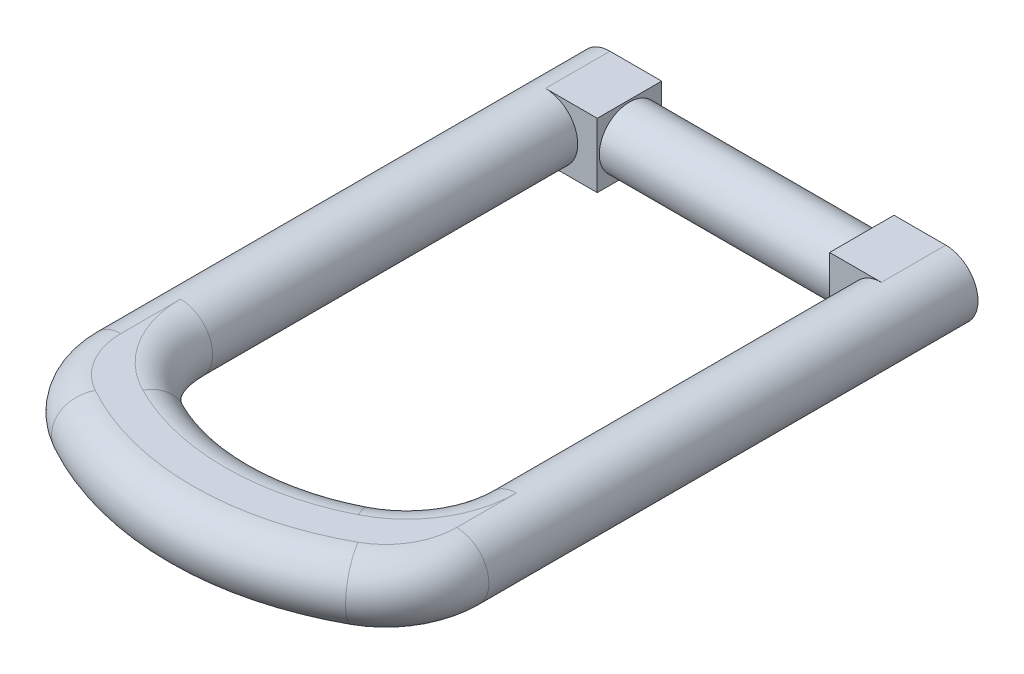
ISO-10303-21;
HEADER;
FILE_DESCRIPTION(('STEP AP214'),'2;1');
FILE_NAME('part.step','',(''),(''),'','','');
FILE_SCHEMA(('AUTOMOTIVE_DESIGN { 1 0 10303 214 1 1 1 1 }'));
ENDSEC;
DATA;
#1=APPLICATION_CONTEXT('core data for automotive mechanical design processes');
#2=APPLICATION_PROTOCOL_DEFINITION('international standard','automotive_design',2000,#1);
#3=PRODUCT_CONTEXT('',#1,'mechanical');
#4=PRODUCT('Part','Part','',(#3));
#5=PRODUCT_RELATED_PRODUCT_CATEGORY('part','',(#4));
#6=PRODUCT_DEFINITION_FORMATION('','',#4);
#7=PRODUCT_DEFINITION_CONTEXT('part definition',#1,'design');
#8=PRODUCT_DEFINITION('design','',#6,#7);
#9=PRODUCT_DEFINITION_SHAPE('','',#8);
#10=(LENGTH_UNIT() NAMED_UNIT(*) SI_UNIT(.MILLI.,.METRE.));
#11=(NAMED_UNIT(*) PLANE_ANGLE_UNIT() SI_UNIT($,.RADIAN.));
#12=(NAMED_UNIT(*) SI_UNIT($,.STERADIAN.) SOLID_ANGLE_UNIT());
#13=UNCERTAINTY_MEASURE_WITH_UNIT(LENGTH_MEASURE(1.E-05),#10,'distance_accuracy_value','');
#14=(GEOMETRIC_REPRESENTATION_CONTEXT(3) GLOBAL_UNCERTAINTY_ASSIGNED_CONTEXT((#13)) GLOBAL_UNIT_ASSIGNED_CONTEXT((#10,
#11,#12)) REPRESENTATION_CONTEXT('',''));
#15=CARTESIAN_POINT('',(0.,0.,0.));
#16=DIRECTION('',(0.,0.,1.));
#17=DIRECTION('',(1.,0.,0.));
#18=AXIS2_PLACEMENT_3D('',#15,#16,#17);
#19=CARTESIAN_POINT('',(50.0632034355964,0.,0.));
#20=DIRECTION('',(-1.,0.,0.));
#21=DIRECTION('',(0.,-1.,0.));
#22=AXIS2_PLACEMENT_3D('',#19,#20,#21);
#23=CYLINDRICAL_SURFACE('',#22,7.5);
#24=CARTESIAN_POINT('',(-28.85,0.,0.));
#25=DIRECTION('',(-1.,0.,0.));
#26=DIRECTION('',(0.,-1.,0.));
#27=AXIS2_PLACEMENT_3D('',#24,#25,#26);
#28=CIRCLE('',#27,7.5);
#29=CARTESIAN_POINT('',(-28.85,-7.5,0.));
#30=VERTEX_POINT('',#29);
#31=EDGE_CURVE('E208',#30,#30,#28,.F.);
#32=ORIENTED_EDGE('',*,*,#31,.T.);
#33=EDGE_LOOP('',(#32));
#34=FACE_BOUND('',#33,.T.);
#35=CARTESIAN_POINT('',(28.85,0.,0.));
#36=DIRECTION('',(1.,0.,0.));
#37=DIRECTION('',(0.,1.,0.));
#38=AXIS2_PLACEMENT_3D('',#35,#36,#37);
#39=CIRCLE('',#38,7.5);
#40=CARTESIAN_POINT('',(28.85,7.5,0.));
#41=VERTEX_POINT('',#40);
#42=EDGE_CURVE('E205',#41,#41,#39,.F.);
#43=ORIENTED_EDGE('',*,*,#42,.T.);
#44=EDGE_LOOP('',(#43));
#45=FACE_BOUND('',#44,.T.);
#46=ADVANCED_FACE('F14',(#34,#45),#23,.T.);
#47=CARTESIAN_POINT('',(-28.85,-68.95,-54.5));
#48=DIRECTION('',(-1.,0.,0.));
#49=DIRECTION('',(0.,-1.,0.));
#50=AXIS2_PLACEMENT_3D('',#47,#48,#49);
#51=PLANE('',#50);
#52=ORIENTED_EDGE('',*,*,#31,.F.);
#53=EDGE_LOOP('',(#52));
#54=FACE_BOUND('',#53,.T.);
#55=DIRECTION('',(0.,0.,1.));
#56=VECTOR('',#55,1.);
#57=CARTESIAN_POINT('',(-28.85,-8.,19.2));
#58=LINE('',#57,#56);
#59=CARTESIAN_POINT('',(-28.85,-8.,-8.));
#60=VERTEX_POINT('',#59);
#61=CARTESIAN_POINT('',(-28.85,-8.,8.));
#62=VERTEX_POINT('',#61);
#63=EDGE_CURVE('E197',#60,#62,#58,.T.);
#64=ORIENTED_EDGE('',*,*,#63,.F.);
#65=DIRECTION('',(0.,-1.,0.));
#66=VECTOR('',#65,1.);
#67=CARTESIAN_POINT('',(-28.85,19.25,-8.));
#68=LINE('',#67,#66);
#69=CARTESIAN_POINT('',(-28.85,8.,-8.));
#70=VERTEX_POINT('',#69);
#71=EDGE_CURVE('E191',#70,#60,#68,.T.);
#72=ORIENTED_EDGE('',*,*,#71,.F.);
#73=DIRECTION('',(0.,0.,1.));
#74=VECTOR('',#73,1.);
#75=CARTESIAN_POINT('',(-28.85,8.,19.2));
#76=LINE('',#75,#74);
#77=CARTESIAN_POINT('',(-28.85,8.,8.));
#78=VERTEX_POINT('',#77);
#79=EDGE_CURVE('E189',#70,#78,#76,.T.);
#80=ORIENTED_EDGE('',*,*,#79,.T.);
#81=DIRECTION('',(0.,1.,0.));
#82=VECTOR('',#81,1.);
#83=CARTESIAN_POINT('',(-28.85,19.25,8.));
#84=LINE('',#83,#82);
#85=EDGE_CURVE('E194',#62,#78,#84,.T.);
#86=ORIENTED_EDGE('',*,*,#85,.F.);
#87=EDGE_LOOP('',(#64,#72,#80,#86));
#88=FACE_BOUND('',#87,.T.);
#89=ADVANCED_FACE('F275',(#54,#88),#51,.F.);
#90=CARTESIAN_POINT('',(-24.1,-8.,101.46584866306));
#91=DIRECTION('',(0.,1.,0.));
#92=DIRECTION('',(-1.,0.,0.));
#93=AXIS2_PLACEMENT_3D('',#90,#91,#92);
#94=PLANE('',#93);
#95=DIRECTION('',(-1.,0.,0.));
#96=VECTOR('',#95,1.);
#97=CARTESIAN_POINT('',(-33.7,-8.,8.));
#98=LINE('',#97,#96);
#99=CARTESIAN_POINT('',(-41.7,-8.,8.));
#100=VERTEX_POINT('',#99);
#101=EDGE_CURVE('E171',#62,#100,#98,.T.);
#102=ORIENTED_EDGE('',*,*,#101,.T.);
#103=DIRECTION('',(0.,0.,-1.));
#104=VECTOR('',#103,1.);
#105=CARTESIAN_POINT('',(-41.7,-8.,101.46584866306));
#106=LINE('',#105,#104);
#107=CARTESIAN_POINT('',(-41.7,-8.,-8.));
#108=VERTEX_POINT('',#107);
#109=EDGE_CURVE('E33',#100,#108,#106,.T.);
#110=ORIENTED_EDGE('',*,*,#109,.T.);
#111=DIRECTION('',(1.,0.,0.));
#112=VECTOR('',#111,1.);
#113=CARTESIAN_POINT('',(-49.7,-8.,-8.));
#114=LINE('',#113,#112);
#115=EDGE_CURVE('E179',#108,#60,#114,.T.);
#116=ORIENTED_EDGE('',*,*,#115,.T.);
#117=ORIENTED_EDGE('',*,*,#63,.T.);
#118=EDGE_LOOP('',(#102,#110,#116,#117));
#119=FACE_BOUND('',#118,.T.);
#120=ADVANCED_FACE('F286',(#119),#94,.F.);
#121=CARTESIAN_POINT('',(-41.7,0.,101.46584866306));
#122=DIRECTION('',(0.,0.,-1.));
#123=DIRECTION('',(-1.,0.,0.));
#124=AXIS2_PLACEMENT_3D('',#121,#122,#123);
#125=CYLINDRICAL_SURFACE('',#124,8.);
#126=DIRECTION('',(0.,0.,-1.));
#127=VECTOR('',#126,1.);
#128=CARTESIAN_POINT('',(-41.7,8.,113.46584866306));
#129=LINE('',#128,#127);
#130=CARTESIAN_POINT('',(-41.7,8.,98.63843571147));
#131=VERTEX_POINT('',#130);
#132=CARTESIAN_POINT('',(-41.7,8.,113.46584866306));
#133=VERTEX_POINT('',#132);
#134=EDGE_CURVE('E231',#131,#133,#129,.F.);
#135=ORIENTED_EDGE('',*,*,#134,.F.);
#136=CARTESIAN_POINT('',(-41.7,0.,98.63843571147));
#137=DIRECTION('',(0.,0.,1.));
#138=DIRECTION('',(0.,1.,0.));
#139=AXIS2_PLACEMENT_3D('',#136,#137,#138);
#140=CIRCLE('',#139,8.);
#141=CARTESIAN_POINT('',(-41.7,-8.,98.63843571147));
#142=VERTEX_POINT('',#141);
#143=EDGE_CURVE('E219',#142,#131,#140,.T.);
#144=ORIENTED_EDGE('',*,*,#143,.F.);
#145=DIRECTION('',(0.,0.,-1.));
#146=VECTOR('',#145,1.);
#147=CARTESIAN_POINT('',(-41.7,-8.,113.46584866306));
#148=LINE('',#147,#146);
#149=CARTESIAN_POINT('',(-41.7,-8.,113.46584866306));
#150=VERTEX_POINT('',#149);
#151=EDGE_CURVE('E86',#150,#142,#148,.T.);
#152=ORIENTED_EDGE('',*,*,#151,.F.);
#153=CARTESIAN_POINT('',(-41.7,0.,113.46584866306));
#154=DIRECTION('',(0.,0.,-1.));
#155=DIRECTION('',(0.,-1.,0.));
#156=AXIS2_PLACEMENT_3D('',#153,#154,#155);
#157=CIRCLE('',#156,8.);
#158=EDGE_CURVE('E224',#150,#133,#157,.T.);
#159=ORIENTED_EDGE('',*,*,#158,.T.);
#160=EDGE_LOOP('',(#135,#144,#152,#159));
#161=FACE_BOUND('',#160,.T.);
#162=ORIENTED_EDGE('',*,*,#109,.F.);
#163=CARTESIAN_POINT('',(-41.7,0.,8.));
#164=DIRECTION('',(0.,0.,-1.));
#165=DIRECTION('',(0.,1.,0.));
#166=AXIS2_PLACEMENT_3D('',#163,#164,#165);
#167=CIRCLE('',#166,8.);
#168=CARTESIAN_POINT('',(-41.7,8.,8.));
#169=VERTEX_POINT('',#168);
#170=EDGE_CURVE('E24',#169,#100,#167,.T.);
#171=ORIENTED_EDGE('',*,*,#170,.F.);
#172=DIRECTION('',(0.,0.,-1.));
#173=VECTOR('',#172,1.);
#174=CARTESIAN_POINT('',(-41.7,8.,101.46584866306));
#175=LINE('',#174,#173);
#176=CARTESIAN_POINT('',(-41.7,8.,-8.));
#177=VERTEX_POINT('',#176);
#178=EDGE_CURVE('E158',#177,#169,#175,.F.);
#179=ORIENTED_EDGE('',*,*,#178,.F.);
#180=CARTESIAN_POINT('',(-41.7,0.,-8.));
#181=DIRECTION('',(0.,0.,1.));
#182=DIRECTION('',(1.,0.,0.));
#183=AXIS2_PLACEMENT_3D('',#180,#181,#182);
#184=CIRCLE('',#183,8.);
#185=EDGE_CURVE('E203',#108,#177,#184,.F.);
#186=ORIENTED_EDGE('',*,*,#185,.F.);
#187=EDGE_LOOP('',(#162,#171,#179,#186));
#188=FACE_BOUND('',#187,.T.);
#189=ADVANCED_FACE('F297',(#161,#188),#125,.T.);
#190=CARTESIAN_POINT('',(-49.7,-8.,-8.));
#191=DIRECTION('',(0.,0.,1.));
#192=DIRECTION('',(1.,0.,0.));
#193=AXIS2_PLACEMENT_3D('',#190,#191,#192);
#194=PLANE('',#193);
#195=ORIENTED_EDGE('',*,*,#185,.T.);
#196=DIRECTION('',(1.,0.,0.));
#197=VECTOR('',#196,1.);
#198=CARTESIAN_POINT('',(-49.7,8.,-8.));
#199=LINE('',#198,#197);
#200=EDGE_CURVE('E173',#177,#70,#199,.T.);
#201=ORIENTED_EDGE('',*,*,#200,.T.);
#202=ORIENTED_EDGE('',*,*,#71,.T.);
#203=ORIENTED_EDGE('',*,*,#115,.F.);
#204=EDGE_LOOP('',(#195,#201,#202,#203));
#205=FACE_BOUND('',#204,.T.);
#206=ADVANCED_FACE('F277',(#205),#194,.F.);
#207=CARTESIAN_POINT('',(-24.1,8.,101.46584866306));
#208=DIRECTION('',(0.,1.,0.));
#209=DIRECTION('',(-1.,0.,0.));
#210=AXIS2_PLACEMENT_3D('',#207,#208,#209);
#211=PLANE('',#210);
#212=ORIENTED_EDGE('',*,*,#178,.T.);
#213=DIRECTION('',(-1.,0.,0.));
#214=VECTOR('',#213,1.);
#215=CARTESIAN_POINT('',(-33.7,8.,8.));
#216=LINE('',#215,#214);
#217=EDGE_CURVE('E154',#78,#169,#216,.T.);
#218=ORIENTED_EDGE('',*,*,#217,.F.);
#219=ORIENTED_EDGE('',*,*,#79,.F.);
#220=ORIENTED_EDGE('',*,*,#200,.F.);
#221=EDGE_LOOP('',(#212,#218,#219,#220));
#222=FACE_BOUND('',#221,.T.);
#223=ADVANCED_FACE('F272',(#222),#211,.T.);
#224=CARTESIAN_POINT('',(-33.7,-8.,8.));
#225=DIRECTION('',(0.,0.,-1.));
#226=DIRECTION('',(0.,-1.,0.));
#227=AXIS2_PLACEMENT_3D('',#224,#225,#226);
#228=PLANE('',#227);
#229=ORIENTED_EDGE('',*,*,#217,.T.);
#230=ORIENTED_EDGE('',*,*,#170,.T.);
#231=ORIENTED_EDGE('',*,*,#101,.F.);
#232=ORIENTED_EDGE('',*,*,#85,.T.);
#233=EDGE_LOOP('',(#229,#230,#231,#232));
#234=FACE_BOUND('',#233,.T.);
#235=ADVANCED_FACE('F269',(#234),#228,.F.);
#236=CARTESIAN_POINT('',(49.7,-8.,-8.));
#237=DIRECTION('',(0.,0.,1.));
#238=DIRECTION('',(1.,0.,0.));
#239=AXIS2_PLACEMENT_3D('',#236,#237,#238);
#240=PLANE('',#239);
#241=DIRECTION('',(1.,0.,0.));
#242=VECTOR('',#241,1.);
#243=CARTESIAN_POINT('',(49.7,8.,-8.));
#244=LINE('',#243,#242);
#245=CARTESIAN_POINT('',(28.85,8.,-8.));
#246=VERTEX_POINT('',#245);
#247=CARTESIAN_POINT('',(41.7,8.,-8.));
#248=VERTEX_POINT('',#247);
#249=EDGE_CURVE('E153',#246,#248,#244,.T.);
#250=ORIENTED_EDGE('',*,*,#249,.T.);
#251=CARTESIAN_POINT('',(41.7,0.,-8.));
#252=DIRECTION('',(0.,0.,1.));
#253=DIRECTION('',(1.,0.,0.));
#254=AXIS2_PLACEMENT_3D('',#251,#252,#253);
#255=CIRCLE('',#254,8.);
#256=CARTESIAN_POINT('',(41.7,-8.,-8.));
#257=VERTEX_POINT('',#256);
#258=EDGE_CURVE('E156',#248,#257,#255,.F.);
#259=ORIENTED_EDGE('',*,*,#258,.T.);
#260=DIRECTION('',(1.,0.,0.));
#261=VECTOR('',#260,1.);
#262=CARTESIAN_POINT('',(49.7,-8.,-8.));
#263=LINE('',#262,#261);
#264=CARTESIAN_POINT('',(28.85,-8.,-8.));
#265=VERTEX_POINT('',#264);
#266=EDGE_CURVE('E175',#265,#257,#263,.T.);
#267=ORIENTED_EDGE('',*,*,#266,.F.);
#268=DIRECTION('',(0.,1.,0.));
#269=VECTOR('',#268,1.);
#270=CARTESIAN_POINT('',(28.85,19.25,-8.));
#271=LINE('',#270,#269);
#272=EDGE_CURVE('E166',#265,#246,#271,.T.);
#273=ORIENTED_EDGE('',*,*,#272,.T.);
#274=EDGE_LOOP('',(#250,#259,#267,#273));
#275=FACE_BOUND('',#274,.T.);
#276=ADVANCED_FACE('F280',(#275),#240,.F.);
#277=CARTESIAN_POINT('',(28.85,-68.95,-54.5));
#278=DIRECTION('',(1.,0.,0.));
#279=DIRECTION('',(0.,1.,0.));
#280=AXIS2_PLACEMENT_3D('',#277,#278,#279);
#281=PLANE('',#280);
#282=ORIENTED_EDGE('',*,*,#42,.F.);
#283=EDGE_LOOP('',(#282));
#284=FACE_BOUND('',#283,.T.);
#285=DIRECTION('',(0.,0.,-1.));
#286=VECTOR('',#285,1.);
#287=CARTESIAN_POINT('',(28.85,8.,19.2));
#288=LINE('',#287,#286);
#289=CARTESIAN_POINT('',(28.85,8.,8.));
#290=VERTEX_POINT('',#289);
#291=EDGE_CURVE('E152',#290,#246,#288,.T.);
#292=ORIENTED_EDGE('',*,*,#291,.T.);
#293=ORIENTED_EDGE('',*,*,#272,.F.);
#294=DIRECTION('',(0.,0.,-1.));
#295=VECTOR('',#294,1.);
#296=CARTESIAN_POINT('',(28.85,-8.,19.2));
#297=LINE('',#296,#295);
#298=CARTESIAN_POINT('',(28.85,-8.,8.));
#299=VERTEX_POINT('',#298);
#300=EDGE_CURVE('E187',#299,#265,#297,.T.);
#301=ORIENTED_EDGE('',*,*,#300,.F.);
#302=DIRECTION('',(0.,-1.,0.));
#303=VECTOR('',#302,1.);
#304=CARTESIAN_POINT('',(28.85,19.25,8.));
#305=LINE('',#304,#303);
#306=EDGE_CURVE('E161',#290,#299,#305,.T.);
#307=ORIENTED_EDGE('',*,*,#306,.F.);
#308=EDGE_LOOP('',(#292,#293,#301,#307));
#309=FACE_BOUND('',#308,.T.);
#310=ADVANCED_FACE('F282',(#284,#309),#281,.F.);
#311=DIRECTION('',(-1.,0.,0.));
#312=VECTOR('',#311,1.);
#313=CARTESIAN_POINT('',(33.7,8.,8.));
#314=LINE('',#313,#312);
#315=CARTESIAN_POINT('',(41.7,8.,8.));
#316=VERTEX_POINT('',#315);
#317=EDGE_CURVE('E139',#316,#290,#314,.T.);
#318=ORIENTED_EDGE('',*,*,#317,.F.);
#319=DIRECTION('',(0.,0.,1.));
#320=VECTOR('',#319,1.);
#321=CARTESIAN_POINT('',(41.7,8.,-8.));
#322=LINE('',#321,#320);
#323=EDGE_CURVE('E18',#316,#248,#322,.F.);
#324=ORIENTED_EDGE('',*,*,#323,.T.);
#325=ORIENTED_EDGE('',*,*,#249,.F.);
#326=ORIENTED_EDGE('',*,*,#291,.F.);
#327=EDGE_LOOP('',(#318,#324,#325,#326));
#328=FACE_BOUND('',#327,.T.);
#329=ADVANCED_FACE('F149',(#328),#211,.T.);
#330=DIRECTION('',(0.,0.,1.));
#331=VECTOR('',#330,1.);
#332=CARTESIAN_POINT('',(41.7,-8.,101.46584866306));
#333=LINE('',#332,#331);
#334=CARTESIAN_POINT('',(41.7,-8.,8.));
#335=VERTEX_POINT('',#334);
#336=EDGE_CURVE('E157',#257,#335,#333,.T.);
#337=ORIENTED_EDGE('',*,*,#336,.T.);
#338=DIRECTION('',(-1.,0.,0.));
#339=VECTOR('',#338,1.);
#340=CARTESIAN_POINT('',(33.7,-8.,8.));
#341=LINE('',#340,#339);
#342=EDGE_CURVE('E141',#335,#299,#341,.T.);
#343=ORIENTED_EDGE('',*,*,#342,.T.);
#344=ORIENTED_EDGE('',*,*,#300,.T.);
#345=ORIENTED_EDGE('',*,*,#266,.T.);
#346=EDGE_LOOP('',(#337,#343,#344,#345));
#347=FACE_BOUND('',#346,.T.);
#348=ADVANCED_FACE('F283',(#347),#94,.F.);
#349=CARTESIAN_POINT('',(33.7,-8.,8.));
#350=DIRECTION('',(0.,0.,-1.));
#351=DIRECTION('',(0.,-1.,0.));
#352=AXIS2_PLACEMENT_3D('',#349,#350,#351);
#353=PLANE('',#352);
#354=ORIENTED_EDGE('',*,*,#342,.F.);
#355=CARTESIAN_POINT('',(41.7,0.,8.));
#356=DIRECTION('',(0.,0.,-1.));
#357=DIRECTION('',(0.,1.,0.));
#358=AXIS2_PLACEMENT_3D('',#355,#356,#357);
#359=CIRCLE('',#358,8.);
#360=EDGE_CURVE('E9',#335,#316,#359,.T.);
#361=ORIENTED_EDGE('',*,*,#360,.T.);
#362=ORIENTED_EDGE('',*,*,#317,.T.);
#363=ORIENTED_EDGE('',*,*,#306,.T.);
#364=EDGE_LOOP('',(#354,#361,#362,#363));
#365=FACE_BOUND('',#364,.T.);
#366=ADVANCED_FACE('F137',(#365),#353,.F.);
#367=CARTESIAN_POINT('',(41.7,0.,101.46584866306));
#368=DIRECTION('',(0.,0.,1.));
#369=DIRECTION('',(1.,0.,0.));
#370=AXIS2_PLACEMENT_3D('',#367,#368,#369);
#371=CYLINDRICAL_SURFACE('',#370,8.);
#372=CARTESIAN_POINT('',(41.7,0.,98.63843571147));
#373=DIRECTION('',(0.,0.,1.));
#374=DIRECTION('',(0.,1.,0.));
#375=AXIS2_PLACEMENT_3D('',#372,#373,#374);
#376=CIRCLE('',#375,8.);
#377=CARTESIAN_POINT('',(41.7,8.,98.63843571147));
#378=VERTEX_POINT('',#377);
#379=CARTESIAN_POINT('',(41.7,-8.,98.63843571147));
#380=VERTEX_POINT('',#379);
#381=EDGE_CURVE('E216',#378,#380,#376,.T.);
#382=ORIENTED_EDGE('',*,*,#381,.F.);
#383=DIRECTION('',(0.,0.,1.));
#384=VECTOR('',#383,1.);
#385=CARTESIAN_POINT('',(41.7,8.,4.));
#386=LINE('',#385,#384);
#387=CARTESIAN_POINT('',(41.7,8.,113.46584866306));
#388=VERTEX_POINT('',#387);
#389=EDGE_CURVE('E252',#388,#378,#386,.F.);
#390=ORIENTED_EDGE('',*,*,#389,.F.);
#391=CARTESIAN_POINT('',(41.7,0.,113.46584866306));
#392=DIRECTION('',(0.,0.,-1.));
#393=DIRECTION('',(0.,-1.,0.));
#394=AXIS2_PLACEMENT_3D('',#391,#392,#393);
#395=CIRCLE('',#394,8.);
#396=CARTESIAN_POINT('',(41.7,-8.,113.46584866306));
#397=VERTEX_POINT('',#396);
#398=EDGE_CURVE('E221',#388,#397,#395,.T.);
#399=ORIENTED_EDGE('',*,*,#398,.T.);
#400=DIRECTION('',(0.,0.,1.));
#401=VECTOR('',#400,1.);
#402=CARTESIAN_POINT('',(41.7,-8.,113.46584866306));
#403=LINE('',#402,#401);
#404=EDGE_CURVE('E255',#380,#397,#403,.T.);
#405=ORIENTED_EDGE('',*,*,#404,.F.);
#406=EDGE_LOOP('',(#382,#390,#399,#405));
#407=FACE_BOUND('',#406,.T.);
#408=ORIENTED_EDGE('',*,*,#323,.F.);
#409=ORIENTED_EDGE('',*,*,#360,.F.);
#410=ORIENTED_EDGE('',*,*,#336,.F.);
#411=ORIENTED_EDGE('',*,*,#258,.F.);
#412=EDGE_LOOP('',(#408,#409,#410,#411));
#413=FACE_BOUND('',#412,.T.);
#414=ADVANCED_FACE('F155',(#407,#413),#371,.T.);
#415=CARTESIAN_POINT('',(0.,0.,70.));
#416=DIRECTION('',(0.,1.,0.));
#417=DIRECTION('',(-1.,0.,0.));
#418=AXIS2_PLACEMENT_3D('',#415,#416,#417);
#419=TOROIDAL_SURFACE('',#418,67.3,8.);
#420=CARTESIAN_POINT('',(-32.6344064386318,0.,128.858181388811));
#421=DIRECTION('',(-0.874564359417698,0.,-0.484909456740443));
#422=DIRECTION('',(-0.484909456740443,0.,0.874564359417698));
#423=AXIS2_PLACEMENT_3D('',#420,#421,#422);
#424=CIRCLE('',#423,8.);
#425=CARTESIAN_POINT('',(-32.6344064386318,-8.,128.858181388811));
#426=VERTEX_POINT('',#425);
#427=CARTESIAN_POINT('',(-32.6344064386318,8.,128.858181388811));
#428=VERTEX_POINT('',#427);
#429=EDGE_CURVE('E229',#426,#428,#424,.T.);
#430=ORIENTED_EDGE('',*,*,#429,.F.);
#431=CARTESIAN_POINT('',(0.,-8.,70.));
#432=DIRECTION('',(0.,1.,0.));
#433=DIRECTION('',(-1.,0.,0.));
#434=AXIS2_PLACEMENT_3D('',#431,#432,#433);
#435=CIRCLE('',#434,67.3);
#436=CARTESIAN_POINT('',(32.6344064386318,-8.,128.858181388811));
#437=VERTEX_POINT('',#436);
#438=EDGE_CURVE('E261',#437,#426,#435,.F.);
#439=ORIENTED_EDGE('',*,*,#438,.F.);
#440=CARTESIAN_POINT('',(32.6344064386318,0.,128.858181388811));
#441=DIRECTION('',(0.874564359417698,0.,-0.484909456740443));
#442=DIRECTION('',(-0.484909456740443,0.,-0.874564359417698));
#443=AXIS2_PLACEMENT_3D('',#440,#441,#442);
#444=CIRCLE('',#443,8.);
#445=CARTESIAN_POINT('',(32.6344064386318,8.,128.858181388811));
#446=VERTEX_POINT('',#445);
#447=EDGE_CURVE('E226',#446,#437,#444,.T.);
#448=ORIENTED_EDGE('',*,*,#447,.F.);
#449=CARTESIAN_POINT('',(0.,8.,70.));
#450=DIRECTION('',(0.,1.,0.));
#451=DIRECTION('',(-1.,0.,0.));
#452=AXIS2_PLACEMENT_3D('',#449,#450,#451);
#453=CIRCLE('',#452,67.3);
#454=EDGE_CURVE('E240',#428,#446,#453,.T.);
#455=ORIENTED_EDGE('',*,*,#454,.F.);
#456=EDGE_LOOP('',(#430,#439,#448,#455));
#457=FACE_BOUND('',#456,.T.);
#458=ADVANCED_FACE('F313',(#457),#419,.T.);
#459=CARTESIAN_POINT('',(0.,0.,70.));
#460=DIRECTION('',(0.,1.,0.));
#461=DIRECTION('',(-1.,0.,0.));
#462=AXIS2_PLACEMENT_3D('',#459,#460,#461);
#463=TOROIDAL_SURFACE('',#462,59.3,8.);
#464=CARTESIAN_POINT('',(0.,-8.,70.));
#465=DIRECTION('',(0.,1.,0.));
#466=DIRECTION('',(-1.,0.,0.));
#467=AXIS2_PLACEMENT_3D('',#464,#465,#466);
#468=CIRCLE('',#467,59.3);
#469=CARTESIAN_POINT('',(-26.7866043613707,-8.,122.905272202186));
#470=VERTEX_POINT('',#469);
#471=CARTESIAN_POINT('',(26.7866043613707,-8.,122.905272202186));
#472=VERTEX_POINT('',#471);
#473=EDGE_CURVE('E263',#470,#472,#468,.T.);
#474=ORIENTED_EDGE('',*,*,#473,.F.);
#475=CARTESIAN_POINT('',(-26.7866043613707,0.,122.905272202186));
#476=DIRECTION('',(0.892163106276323,0.,0.451713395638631));
#477=DIRECTION('',(0.451713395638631,0.,-0.892163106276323));
#478=AXIS2_PLACEMENT_3D('',#475,#476,#477);
#479=CIRCLE('',#478,8.);
#480=CARTESIAN_POINT('',(-26.7866043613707,8.,122.905272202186));
#481=VERTEX_POINT('',#480);
#482=EDGE_CURVE('E214',#470,#481,#479,.T.);
#483=ORIENTED_EDGE('',*,*,#482,.T.);
#484=CARTESIAN_POINT('',(0.,8.,70.));
#485=DIRECTION('',(0.,1.,0.));
#486=DIRECTION('',(-1.,0.,0.));
#487=AXIS2_PLACEMENT_3D('',#484,#485,#486);
#488=CIRCLE('',#487,59.3);
#489=CARTESIAN_POINT('',(26.7866043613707,8.,122.905272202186));
#490=VERTEX_POINT('',#489);
#491=EDGE_CURVE('E243',#490,#481,#488,.F.);
#492=ORIENTED_EDGE('',*,*,#491,.F.);
#493=CARTESIAN_POINT('',(26.7866043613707,0.,122.905272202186));
#494=DIRECTION('',(-0.892163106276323,0.,0.451713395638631));
#495=DIRECTION('',(0.451713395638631,0.,0.892163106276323));
#496=AXIS2_PLACEMENT_3D('',#493,#494,#495);
#497=CIRCLE('',#496,8.);
#498=EDGE_CURVE('E212',#490,#472,#497,.T.);
#499=ORIENTED_EDGE('',*,*,#498,.T.);
#500=EDGE_LOOP('',(#474,#483,#492,#499));
#501=FACE_BOUND('',#500,.T.);
#502=ADVANCED_FACE('F322',(#501),#463,.T.);
#503=CARTESIAN_POINT('',(24.1,0.,113.46584866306));
#504=DIRECTION('',(0.,1.,0.));
#505=DIRECTION('',(-1.,0.,0.));
#506=AXIS2_PLACEMENT_3D('',#503,#504,#505);
#507=TOROIDAL_SURFACE('',#506,17.6,8.);
#508=ORIENTED_EDGE('',*,*,#447,.T.);
#509=CARTESIAN_POINT('',(24.1,-8.,113.46584866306));
#510=DIRECTION('',(0.,1.,0.));
#511=DIRECTION('',(-1.,0.,0.));
#512=AXIS2_PLACEMENT_3D('',#509,#510,#511);
#513=CIRCLE('',#512,17.6);
#514=EDGE_CURVE('E257',#397,#437,#513,.F.);
#515=ORIENTED_EDGE('',*,*,#514,.F.);
#516=ORIENTED_EDGE('',*,*,#398,.F.);
#517=CARTESIAN_POINT('',(24.1,8.,113.46584866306));
#518=DIRECTION('',(0.,1.,0.));
#519=DIRECTION('',(-1.,0.,0.));
#520=AXIS2_PLACEMENT_3D('',#517,#518,#519);
#521=CIRCLE('',#520,17.6);
#522=EDGE_CURVE('E246',#446,#388,#521,.T.);
#523=ORIENTED_EDGE('',*,*,#522,.F.);
#524=EDGE_LOOP('',(#508,#515,#516,#523));
#525=FACE_BOUND('',#524,.T.);
#526=ADVANCED_FACE('F310',(#525),#507,.T.);
#527=CARTESIAN_POINT('',(-24.1,0.,113.46584866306));
#528=DIRECTION('',(0.,1.,0.));
#529=DIRECTION('',(-1.,0.,0.));
#530=AXIS2_PLACEMENT_3D('',#527,#528,#529);
#531=TOROIDAL_SURFACE('',#530,17.6,8.);
#532=CARTESIAN_POINT('',(-24.1,-8.,113.46584866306));
#533=DIRECTION('',(0.,1.,0.));
#534=DIRECTION('',(-1.,0.,0.));
#535=AXIS2_PLACEMENT_3D('',#532,#533,#534);
#536=CIRCLE('',#535,17.6);
#537=EDGE_CURVE('E90',#426,#150,#536,.F.);
#538=ORIENTED_EDGE('',*,*,#537,.F.);
#539=ORIENTED_EDGE('',*,*,#429,.T.);
#540=CARTESIAN_POINT('',(-24.1,8.,113.46584866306));
#541=DIRECTION('',(0.,1.,0.));
#542=DIRECTION('',(-1.,0.,0.));
#543=AXIS2_PLACEMENT_3D('',#540,#541,#542);
#544=CIRCLE('',#543,17.6);
#545=EDGE_CURVE('E234',#133,#428,#544,.T.);
#546=ORIENTED_EDGE('',*,*,#545,.F.);
#547=ORIENTED_EDGE('',*,*,#158,.F.);
#548=EDGE_LOOP('',(#538,#539,#546,#547));
#549=FACE_BOUND('',#548,.T.);
#550=ADVANCED_FACE('F300',(#549),#531,.T.);
#551=CARTESIAN_POINT('',(-24.1,-8.,113.46584866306));
#552=DIRECTION('',(0.,1.,0.));
#553=DIRECTION('',(-1.,0.,0.));
#554=AXIS2_PLACEMENT_3D('',#551,#552,#553);
#555=PLANE('',#554);
#556=ORIENTED_EDGE('',*,*,#537,.T.);
#557=ORIENTED_EDGE('',*,*,#151,.T.);
#558=CARTESIAN_POINT('',(-14.5,-8.,98.63843571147));
#559=DIRECTION('',(0.,1.,0.));
#560=DIRECTION('',(-1.,0.,0.));
#561=AXIS2_PLACEMENT_3D('',#558,#559,#560);
#562=CIRCLE('',#561,27.2);
#563=EDGE_CURVE('E266',#142,#470,#562,.T.);
#564=ORIENTED_EDGE('',*,*,#563,.T.);
#565=ORIENTED_EDGE('',*,*,#473,.T.);
#566=CARTESIAN_POINT('',(14.5,-8.,98.63843571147));
#567=DIRECTION('',(0.,1.,0.));
#568=DIRECTION('',(-1.,0.,0.));
#569=AXIS2_PLACEMENT_3D('',#566,#567,#568);
#570=CIRCLE('',#569,27.2);
#571=EDGE_CURVE('E259',#472,#380,#570,.T.);
#572=ORIENTED_EDGE('',*,*,#571,.T.);
#573=ORIENTED_EDGE('',*,*,#404,.T.);
#574=ORIENTED_EDGE('',*,*,#514,.T.);
#575=ORIENTED_EDGE('',*,*,#438,.T.);
#576=EDGE_LOOP('',(#556,#557,#564,#565,#572,#573,#574,#575));
#577=FACE_BOUND('',#576,.T.);
#578=ADVANCED_FACE('F16',(#577),#555,.F.);
#579=CARTESIAN_POINT('',(-14.5,0.,98.63843571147));
#580=DIRECTION('',(0.,1.,0.));
#581=DIRECTION('',(-1.,0.,0.));
#582=AXIS2_PLACEMENT_3D('',#579,#580,#581);
#583=TOROIDAL_SURFACE('',#582,27.2,8.);
#584=ORIENTED_EDGE('',*,*,#563,.F.);
#585=ORIENTED_EDGE('',*,*,#143,.T.);
#586=CARTESIAN_POINT('',(-14.5,8.,98.63843571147));
#587=DIRECTION('',(0.,1.,0.));
#588=DIRECTION('',(-1.,0.,0.));
#589=AXIS2_PLACEMENT_3D('',#586,#587,#588);
#590=CIRCLE('',#589,27.2);
#591=EDGE_CURVE('E237',#481,#131,#590,.F.);
#592=ORIENTED_EDGE('',*,*,#591,.F.);
#593=ORIENTED_EDGE('',*,*,#482,.F.);
#594=EDGE_LOOP('',(#584,#585,#592,#593));
#595=FACE_BOUND('',#594,.T.);
#596=ADVANCED_FACE('F299',(#595),#583,.T.);
#597=CARTESIAN_POINT('',(-24.1,8.,113.46584866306));
#598=DIRECTION('',(0.,1.,0.));
#599=DIRECTION('',(-1.,0.,0.));
#600=AXIS2_PLACEMENT_3D('',#597,#598,#599);
#601=PLANE('',#600);
#602=ORIENTED_EDGE('',*,*,#522,.T.);
#603=ORIENTED_EDGE('',*,*,#389,.T.);
#604=CARTESIAN_POINT('',(14.5,8.,98.63843571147));
#605=DIRECTION('',(0.,1.,0.));
#606=DIRECTION('',(-1.,0.,0.));
#607=AXIS2_PLACEMENT_3D('',#604,#605,#606);
#608=CIRCLE('',#607,27.2);
#609=EDGE_CURVE('E249',#378,#490,#608,.F.);
#610=ORIENTED_EDGE('',*,*,#609,.T.);
#611=ORIENTED_EDGE('',*,*,#491,.T.);
#612=ORIENTED_EDGE('',*,*,#591,.T.);
#613=ORIENTED_EDGE('',*,*,#134,.T.);
#614=ORIENTED_EDGE('',*,*,#545,.T.);
#615=ORIENTED_EDGE('',*,*,#454,.T.);
#616=EDGE_LOOP('',(#602,#603,#610,#611,#612,#613,#614,#615));
#617=FACE_BOUND('',#616,.T.);
#618=ADVANCED_FACE('F301',(#617),#601,.T.);
#619=CARTESIAN_POINT('',(14.5,0.,98.63843571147));
#620=DIRECTION('',(0.,1.,0.));
#621=DIRECTION('',(-1.,0.,0.));
#622=AXIS2_PLACEMENT_3D('',#619,#620,#621);
#623=TOROIDAL_SURFACE('',#622,27.2,8.);
#624=ORIENTED_EDGE('',*,*,#381,.T.);
#625=ORIENTED_EDGE('',*,*,#571,.F.);
#626=ORIENTED_EDGE('',*,*,#498,.F.);
#627=ORIENTED_EDGE('',*,*,#609,.F.);
#628=EDGE_LOOP('',(#624,#625,#626,#627));
#629=FACE_BOUND('',#628,.T.);
#630=ADVANCED_FACE('F309',(#629),#623,.T.);
#631=CLOSED_SHELL('',(#46,#89,#120,#189,#206,#223,#235,#276,#310,#329,#348,#366,#414,#458,#502,
#526,#550,#578,#596,#618,#630));
#632=MANIFOLD_SOLID_BREP('B1',#631);
#633=ADVANCED_BREP_SHAPE_REPRESENTATION('',(#18,#632),#14);
#634=SHAPE_DEFINITION_REPRESENTATION(#9,#633);
ENDSEC;
END-ISO-10303-21;
